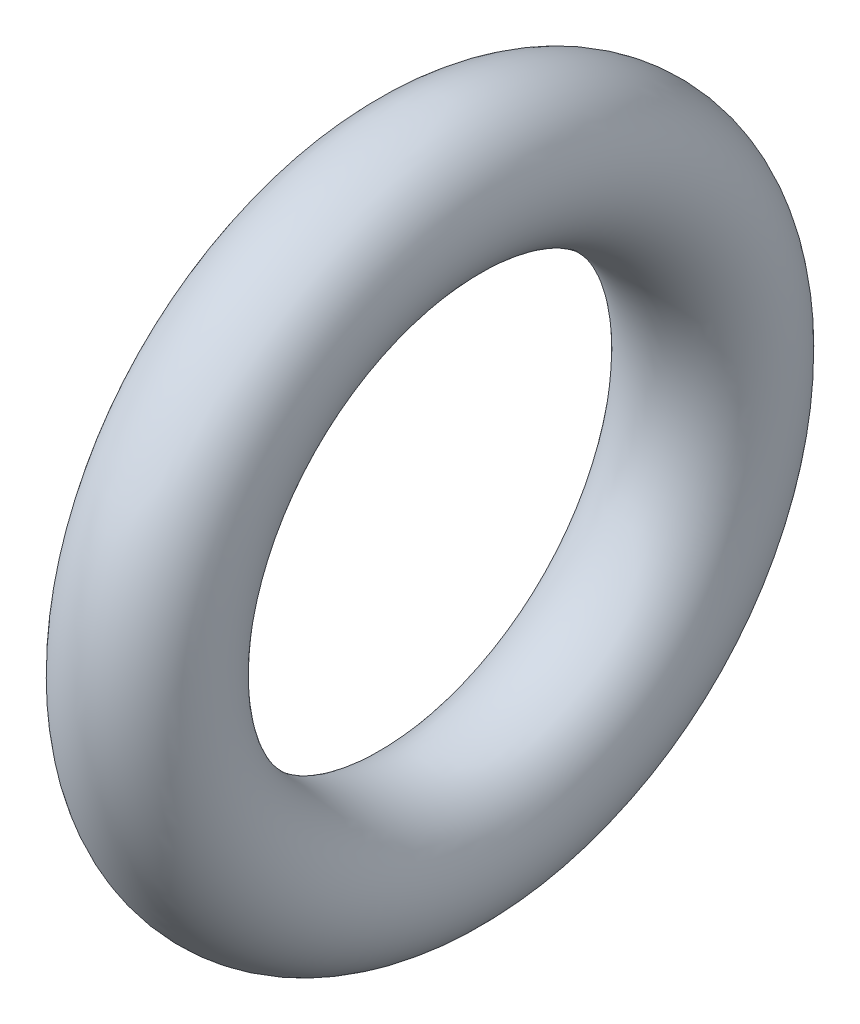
ISO-10303-21;
HEADER;
FILE_DESCRIPTION(('STEP AP214'),'2;1');
FILE_NAME('part.step','',(''),(''),'','','');
FILE_SCHEMA(('AUTOMOTIVE_DESIGN { 1 0 10303 214 1 1 1 1 }'));
ENDSEC;
DATA;
#1=APPLICATION_CONTEXT('core data for automotive mechanical design processes');
#2=APPLICATION_PROTOCOL_DEFINITION('international standard','automotive_design',2000,#1);
#3=PRODUCT_CONTEXT('',#1,'mechanical');
#4=PRODUCT('Part','Part','',(#3));
#5=PRODUCT_RELATED_PRODUCT_CATEGORY('part','',(#4));
#6=PRODUCT_DEFINITION_FORMATION('','',#4);
#7=PRODUCT_DEFINITION_CONTEXT('part definition',#1,'design');
#8=PRODUCT_DEFINITION('design','',#6,#7);
#9=PRODUCT_DEFINITION_SHAPE('','',#8);
#10=(LENGTH_UNIT() NAMED_UNIT(*) SI_UNIT(.MILLI.,.METRE.));
#11=(NAMED_UNIT(*) PLANE_ANGLE_UNIT() SI_UNIT($,.RADIAN.));
#12=(NAMED_UNIT(*) SI_UNIT($,.STERADIAN.) SOLID_ANGLE_UNIT());
#13=UNCERTAINTY_MEASURE_WITH_UNIT(LENGTH_MEASURE(1.E-05),#10,'distance_accuracy_value','');
#14=(GEOMETRIC_REPRESENTATION_CONTEXT(3) GLOBAL_UNCERTAINTY_ASSIGNED_CONTEXT((#13)) GLOBAL_UNIT_ASSIGNED_CONTEXT((#10,
#11,#12)) REPRESENTATION_CONTEXT('',''));
#15=CARTESIAN_POINT('',(0.,0.,0.));
#16=DIRECTION('',(0.,0.,1.));
#17=DIRECTION('',(1.,0.,0.));
#18=AXIS2_PLACEMENT_3D('',#15,#16,#17);
#19=CARTESIAN_POINT('',(0.89,0.,0.));
#20=DIRECTION('',(-1.,0.,0.));
#21=DIRECTION('',(0.,0.,1.));
#22=AXIS2_PLACEMENT_3D('',#19,#20,#21);
#23=TOROIDAL_SURFACE('',#22,3.52,0.89);
#24=CARTESIAN_POINT('',(0.89,0.,4.41));
#25=VERTEX_POINT('',#24);
#26=VERTEX_LOOP('',#25);
#27=FACE_BOUND('',#26,.T.);
#28=ADVANCED_FACE('F20',(#27),#23,.T.);
#29=CLOSED_SHELL('',(#28));
#30=MANIFOLD_SOLID_BREP('B2',#29);
#31=ADVANCED_BREP_SHAPE_REPRESENTATION('',(#18,#30),#14);
#32=SHAPE_DEFINITION_REPRESENTATION(#9,#31);
ENDSEC;
END-ISO-10303-21;
